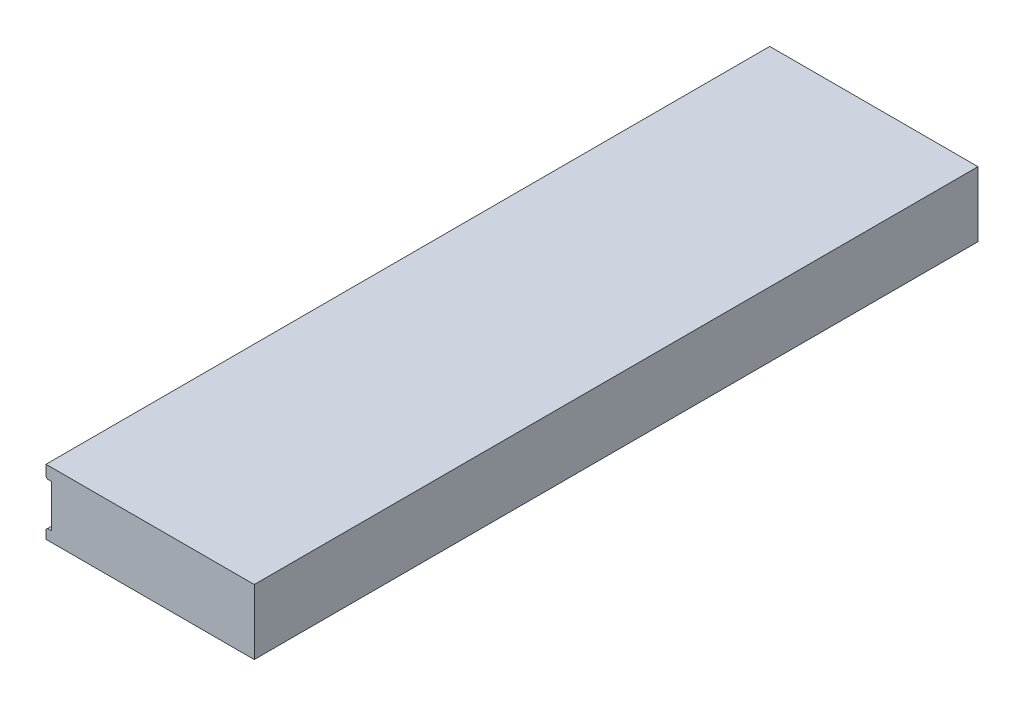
ISO-10303-21;
HEADER;
FILE_DESCRIPTION(('STEP AP214'),'2;1');
FILE_NAME('part.step','',(''),(''),'','','');
FILE_SCHEMA(('AUTOMOTIVE_DESIGN { 1 0 10303 214 1 1 1 1 }'));
ENDSEC;
DATA;
#1=APPLICATION_CONTEXT('core data for automotive mechanical design processes');
#2=APPLICATION_PROTOCOL_DEFINITION('international standard','automotive_design',2000,#1);
#3=PRODUCT_CONTEXT('',#1,'mechanical');
#4=PRODUCT('Part','Part','',(#3));
#5=PRODUCT_RELATED_PRODUCT_CATEGORY('part','',(#4));
#6=PRODUCT_DEFINITION_FORMATION('','',#4);
#7=PRODUCT_DEFINITION_CONTEXT('part definition',#1,'design');
#8=PRODUCT_DEFINITION('design','',#6,#7);
#9=PRODUCT_DEFINITION_SHAPE('','',#8);
#10=(LENGTH_UNIT() NAMED_UNIT(*) SI_UNIT(.MILLI.,.METRE.));
#11=(NAMED_UNIT(*) PLANE_ANGLE_UNIT() SI_UNIT($,.RADIAN.));
#12=(NAMED_UNIT(*) SI_UNIT($,.STERADIAN.) SOLID_ANGLE_UNIT());
#13=UNCERTAINTY_MEASURE_WITH_UNIT(LENGTH_MEASURE(1.E-05),#10,'distance_accuracy_value','');
#14=(GEOMETRIC_REPRESENTATION_CONTEXT(3) GLOBAL_UNCERTAINTY_ASSIGNED_CONTEXT((#13)) GLOBAL_UNIT_ASSIGNED_CONTEXT((#10,
#11,#12)) REPRESENTATION_CONTEXT('',''));
#15=CARTESIAN_POINT('',(0.,0.,0.));
#16=DIRECTION('',(0.,0.,1.));
#17=DIRECTION('',(1.,0.,0.));
#18=AXIS2_PLACEMENT_3D('',#15,#16,#17);
#19=CARTESIAN_POINT('',(-1.39699999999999,0.,90.4748));
#20=DIRECTION('',(0.,-1.,0.));
#21=DIRECTION('',(0.,0.,-1.));
#22=AXIS2_PLACEMENT_3D('',#19,#20,#21);
#23=PLANE('',#22);
#24=DIRECTION('',(-1.,0.,0.));
#25=VECTOR('',#24,1.);
#26=CARTESIAN_POINT('',(-1.39699999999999,0.,-90.4748));
#27=LINE('',#26,#25);
#28=CARTESIAN_POINT('',(50.673,0.,-90.4748));
#29=VERTEX_POINT('',#28);
#30=CARTESIAN_POINT('',(-1.39699999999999,0.,-90.4748));
#31=VERTEX_POINT('',#30);
#32=EDGE_CURVE('E180',#29,#31,#27,.T.);
#33=ORIENTED_EDGE('',*,*,#32,.T.);
#34=DIRECTION('',(0.,0.,-1.));
#35=VECTOR('',#34,1.);
#36=CARTESIAN_POINT('',(-1.39699999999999,0.,90.4748));
#37=LINE('',#36,#35);
#38=CARTESIAN_POINT('',(-1.39699999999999,0.,90.4748));
#39=VERTEX_POINT('',#38);
#40=EDGE_CURVE('E231',#39,#31,#37,.T.);
#41=ORIENTED_EDGE('',*,*,#40,.F.);
#42=DIRECTION('',(-1.,0.,0.));
#43=VECTOR('',#42,1.);
#44=CARTESIAN_POINT('',(-1.39699999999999,0.,90.4748));
#45=LINE('',#44,#43);
#46=CARTESIAN_POINT('',(50.673,0.,90.4748));
#47=VERTEX_POINT('',#46);
#48=EDGE_CURVE('E181',#47,#39,#45,.T.);
#49=ORIENTED_EDGE('',*,*,#48,.F.);
#50=DIRECTION('',(0.,0.,-1.));
#51=VECTOR('',#50,1.);
#52=CARTESIAN_POINT('',(50.673,0.,90.4748));
#53=LINE('',#52,#51);
#54=EDGE_CURVE('E200',#47,#29,#53,.T.);
#55=ORIENTED_EDGE('',*,*,#54,.T.);
#56=EDGE_LOOP('',(#33,#41,#49,#55));
#57=FACE_BOUND('',#56,.T.);
#58=ADVANCED_FACE('F37',(#57),#23,.F.);
#59=CARTESIAN_POINT('',(-1.39699999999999,-3.048,90.4748));
#60=DIRECTION('',(1.,0.,0.));
#61=DIRECTION('',(0.,0.,-1.));
#62=AXIS2_PLACEMENT_3D('',#59,#60,#61);
#63=PLANE('',#62);
#64=DIRECTION('',(0.,-1.,0.));
#65=VECTOR('',#64,1.);
#66=CARTESIAN_POINT('',(-1.39699999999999,-3.048,-90.4748));
#67=LINE('',#66,#65);
#68=CARTESIAN_POINT('',(-1.39699999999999,-2.66699999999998,-90.4748));
#69=VERTEX_POINT('',#68);
#70=EDGE_CURVE('E203',#31,#69,#67,.T.);
#71=ORIENTED_EDGE('',*,*,#70,.T.);
#72=DIRECTION('',(0.,0.,1.));
#73=VECTOR('',#72,1.);
#74=CARTESIAN_POINT('',(-1.39699999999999,-2.66699999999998,90.4748));
#75=LINE('',#74,#73);
#76=CARTESIAN_POINT('',(-1.39699999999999,-2.66699999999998,90.4748));
#77=VERTEX_POINT('',#76);
#78=EDGE_CURVE('E11',#69,#77,#75,.T.);
#79=ORIENTED_EDGE('',*,*,#78,.T.);
#80=DIRECTION('',(0.,-1.,0.));
#81=VECTOR('',#80,1.);
#82=CARTESIAN_POINT('',(-1.39699999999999,-3.048,90.4748));
#83=LINE('',#82,#81);
#84=EDGE_CURVE('E184',#39,#77,#83,.T.);
#85=ORIENTED_EDGE('',*,*,#84,.F.);
#86=ORIENTED_EDGE('',*,*,#40,.T.);
#87=EDGE_LOOP('',(#71,#79,#85,#86));
#88=FACE_BOUND('',#87,.T.);
#89=ADVANCED_FACE('F287',(#88),#63,.F.);
#90=CARTESIAN_POINT('',(0.,-3.048,90.4748));
#91=DIRECTION('',(0.,1.,0.));
#92=DIRECTION('',(0.,0.,1.));
#93=AXIS2_PLACEMENT_3D('',#90,#91,#92);
#94=PLANE('',#93);
#95=DIRECTION('',(1.,0.,0.));
#96=VECTOR('',#95,1.);
#97=CARTESIAN_POINT('',(0.,-3.048,90.4748));
#98=LINE('',#97,#96);
#99=CARTESIAN_POINT('',(-1.016,-3.048,90.4748));
#100=VERTEX_POINT('',#99);
#101=CARTESIAN_POINT('',(0.,-3.048,90.4748));
#102=VERTEX_POINT('',#101);
#103=EDGE_CURVE('E187',#100,#102,#98,.T.);
#104=ORIENTED_EDGE('',*,*,#103,.F.);
#105=DIRECTION('',(0.,0.,-1.));
#106=VECTOR('',#105,1.);
#107=CARTESIAN_POINT('',(-1.016,-3.048,90.4748));
#108=LINE('',#107,#106);
#109=CARTESIAN_POINT('',(-1.016,-3.048,-90.4748));
#110=VERTEX_POINT('',#109);
#111=EDGE_CURVE('E45',#100,#110,#108,.T.);
#112=ORIENTED_EDGE('',*,*,#111,.T.);
#113=DIRECTION('',(1.,0.,0.));
#114=VECTOR('',#113,1.);
#115=CARTESIAN_POINT('',(0.,-3.048,-90.4748));
#116=LINE('',#115,#114);
#117=CARTESIAN_POINT('',(0.,-3.048,-90.4748));
#118=VERTEX_POINT('',#117);
#119=EDGE_CURVE('E205',#110,#118,#116,.T.);
#120=ORIENTED_EDGE('',*,*,#119,.T.);
#121=DIRECTION('',(0.,0.,-1.));
#122=VECTOR('',#121,1.);
#123=CARTESIAN_POINT('',(0.,-3.048,90.4748));
#124=LINE('',#123,#122);
#125=EDGE_CURVE('E228',#102,#118,#124,.T.);
#126=ORIENTED_EDGE('',*,*,#125,.F.);
#127=EDGE_LOOP('',(#104,#112,#120,#126));
#128=FACE_BOUND('',#127,.T.);
#129=ADVANCED_FACE('F249',(#128),#94,.F.);
#130=CARTESIAN_POINT('',(0.,-13.716,90.4748));
#131=DIRECTION('',(1.,0.,0.));
#132=DIRECTION('',(0.,0.,-1.));
#133=AXIS2_PLACEMENT_3D('',#130,#131,#132);
#134=PLANE('',#133);
#135=CARTESIAN_POINT('',(0.,-8.12799999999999,-85.598));
#136=DIRECTION('',(-1.,0.,0.));
#137=DIRECTION('',(0.,0.,1.));
#138=AXIS2_PLACEMENT_3D('',#135,#136,#137);
#139=CIRCLE('',#138,2.413);
#140=CARTESIAN_POINT('',(0.,-8.12799999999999,-83.185));
#141=VERTEX_POINT('',#140);
#142=EDGE_CURVE('E141',#141,#141,#139,.T.);
#143=ORIENTED_EDGE('',*,*,#142,.F.);
#144=EDGE_LOOP('',(#143));
#145=FACE_BOUND('',#144,.T.);
#146=CARTESIAN_POINT('',(0.,-8.12799999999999,85.598));
#147=DIRECTION('',(-1.,0.,0.));
#148=DIRECTION('',(0.,0.,1.));
#149=AXIS2_PLACEMENT_3D('',#146,#147,#148);
#150=CIRCLE('',#149,2.413);
#151=CARTESIAN_POINT('',(0.,-8.12799999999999,88.011));
#152=VERTEX_POINT('',#151);
#153=EDGE_CURVE('E153',#152,#152,#150,.T.);
#154=ORIENTED_EDGE('',*,*,#153,.F.);
#155=EDGE_LOOP('',(#154));
#156=FACE_BOUND('',#155,.T.);
#157=CARTESIAN_POINT('',(0.,-8.128,4.8768));
#158=DIRECTION('',(-1.,0.,0.));
#159=DIRECTION('',(0.,0.,1.));
#160=AXIS2_PLACEMENT_3D('',#157,#158,#159);
#161=CIRCLE('',#160,2.413);
#162=CARTESIAN_POINT('',(0.,-8.128,7.2898));
#163=VERTEX_POINT('',#162);
#164=EDGE_CURVE('E165',#163,#163,#161,.T.);
#165=ORIENTED_EDGE('',*,*,#164,.F.);
#166=EDGE_LOOP('',(#165));
#167=FACE_BOUND('',#166,.T.);
#168=CARTESIAN_POINT('',(0.,-8.128,-4.8768));
#169=DIRECTION('',(-1.,0.,0.));
#170=DIRECTION('',(0.,0.,1.));
#171=AXIS2_PLACEMENT_3D('',#168,#169,#170);
#172=CIRCLE('',#171,2.413);
#173=CARTESIAN_POINT('',(0.,-8.128,-2.4638));
#174=VERTEX_POINT('',#173);
#175=EDGE_CURVE('E177',#174,#174,#172,.T.);
#176=ORIENTED_EDGE('',*,*,#175,.F.);
#177=EDGE_LOOP('',(#176));
#178=FACE_BOUND('',#177,.T.);
#179=DIRECTION('',(0.,-1.,0.));
#180=VECTOR('',#179,1.);
#181=CARTESIAN_POINT('',(0.,-13.716,-90.4748));
#182=LINE('',#181,#180);
#183=CARTESIAN_POINT('',(0.,-13.716,-90.4748));
#184=VERTEX_POINT('',#183);
#185=EDGE_CURVE('E207',#118,#184,#182,.T.);
#186=ORIENTED_EDGE('',*,*,#185,.T.);
#187=DIRECTION('',(0.,0.,-1.));
#188=VECTOR('',#187,1.);
#189=CARTESIAN_POINT('',(0.,-13.716,90.4748));
#190=LINE('',#189,#188);
#191=CARTESIAN_POINT('',(0.,-13.716,90.4748));
#192=VERTEX_POINT('',#191);
#193=EDGE_CURVE('E225',#192,#184,#190,.T.);
#194=ORIENTED_EDGE('',*,*,#193,.F.);
#195=DIRECTION('',(0.,-1.,0.));
#196=VECTOR('',#195,1.);
#197=CARTESIAN_POINT('',(0.,-13.716,90.4748));
#198=LINE('',#197,#196);
#199=EDGE_CURVE('E189',#102,#192,#198,.T.);
#200=ORIENTED_EDGE('',*,*,#199,.F.);
#201=ORIENTED_EDGE('',*,*,#125,.T.);
#202=EDGE_LOOP('',(#186,#194,#200,#201));
#203=FACE_BOUND('',#202,.T.);
#204=ADVANCED_FACE('F259',(#145,#156,#167,#178,#203),#134,.F.);
#205=CARTESIAN_POINT('',(-1.39699999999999,-13.716,90.4748));
#206=DIRECTION('',(0.,-1.,0.));
#207=DIRECTION('',(0.,0.,-1.));
#208=AXIS2_PLACEMENT_3D('',#205,#206,#207);
#209=PLANE('',#208);
#210=DIRECTION('',(-1.,0.,0.));
#211=VECTOR('',#210,1.);
#212=CARTESIAN_POINT('',(-1.39699999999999,-13.716,-90.4748));
#213=LINE('',#212,#211);
#214=CARTESIAN_POINT('',(-1.016,-13.716,-90.4748));
#215=VERTEX_POINT('',#214);
#216=EDGE_CURVE('E209',#184,#215,#213,.T.);
#217=ORIENTED_EDGE('',*,*,#216,.T.);
#218=DIRECTION('',(0.,0.,1.));
#219=VECTOR('',#218,1.);
#220=CARTESIAN_POINT('',(-1.016,-13.716,90.4748));
#221=LINE('',#220,#219);
#222=CARTESIAN_POINT('',(-1.016,-13.716,90.4748));
#223=VERTEX_POINT('',#222);
#224=EDGE_CURVE('E241',#215,#223,#221,.T.);
#225=ORIENTED_EDGE('',*,*,#224,.T.);
#226=DIRECTION('',(-1.,0.,0.));
#227=VECTOR('',#226,1.);
#228=CARTESIAN_POINT('',(-1.39699999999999,-13.716,90.4748));
#229=LINE('',#228,#227);
#230=EDGE_CURVE('E191',#192,#223,#229,.T.);
#231=ORIENTED_EDGE('',*,*,#230,.F.);
#232=ORIENTED_EDGE('',*,*,#193,.T.);
#233=EDGE_LOOP('',(#217,#225,#231,#232));
#234=FACE_BOUND('',#233,.T.);
#235=ADVANCED_FACE('F263',(#234),#209,.F.);
#236=CARTESIAN_POINT('',(-1.39699999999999,-16.256,90.4748));
#237=DIRECTION('',(1.,0.,0.));
#238=DIRECTION('',(0.,0.,-1.));
#239=AXIS2_PLACEMENT_3D('',#236,#237,#238);
#240=PLANE('',#239);
#241=DIRECTION('',(0.,-1.,0.));
#242=VECTOR('',#241,1.);
#243=CARTESIAN_POINT('',(-1.39699999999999,-16.256,90.4748));
#244=LINE('',#243,#242);
#245=CARTESIAN_POINT('',(-1.39699999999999,-14.097,90.4748));
#246=VERTEX_POINT('',#245);
#247=CARTESIAN_POINT('',(-1.39699999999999,-16.256,90.4748));
#248=VERTEX_POINT('',#247);
#249=EDGE_CURVE('E194',#246,#248,#244,.T.);
#250=ORIENTED_EDGE('',*,*,#249,.F.);
#251=DIRECTION('',(0.,0.,-1.));
#252=VECTOR('',#251,1.);
#253=CARTESIAN_POINT('',(-1.39699999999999,-14.097,90.4748));
#254=LINE('',#253,#252);
#255=CARTESIAN_POINT('',(-1.39699999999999,-14.097,-90.4748));
#256=VERTEX_POINT('',#255);
#257=EDGE_CURVE('E234',#246,#256,#254,.T.);
#258=ORIENTED_EDGE('',*,*,#257,.T.);
#259=DIRECTION('',(0.,-1.,0.));
#260=VECTOR('',#259,1.);
#261=CARTESIAN_POINT('',(-1.39699999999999,-16.256,-90.4748));
#262=LINE('',#261,#260);
#263=CARTESIAN_POINT('',(-1.39699999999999,-16.256,-90.4748));
#264=VERTEX_POINT('',#263);
#265=EDGE_CURVE('E212',#256,#264,#262,.T.);
#266=ORIENTED_EDGE('',*,*,#265,.T.);
#267=DIRECTION('',(0.,0.,-1.));
#268=VECTOR('',#267,1.);
#269=CARTESIAN_POINT('',(-1.39699999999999,-16.256,90.4748));
#270=LINE('',#269,#268);
#271=EDGE_CURVE('E222',#248,#264,#270,.T.);
#272=ORIENTED_EDGE('',*,*,#271,.F.);
#273=EDGE_LOOP('',(#250,#258,#266,#272));
#274=FACE_BOUND('',#273,.T.);
#275=ADVANCED_FACE('F271',(#274),#240,.F.);
#276=CARTESIAN_POINT('',(50.673,-16.256,90.4748));
#277=DIRECTION('',(0.,1.,0.));
#278=DIRECTION('',(-1.,0.,0.));
#279=AXIS2_PLACEMENT_3D('',#276,#277,#278);
#280=PLANE('',#279);
#281=DIRECTION('',(1.,0.,0.));
#282=VECTOR('',#281,1.);
#283=CARTESIAN_POINT('',(50.673,-16.256,-90.4748));
#284=LINE('',#283,#282);
#285=CARTESIAN_POINT('',(50.673,-16.256,-90.4748));
#286=VERTEX_POINT('',#285);
#287=EDGE_CURVE('E214',#264,#286,#284,.T.);
#288=ORIENTED_EDGE('',*,*,#287,.T.);
#289=DIRECTION('',(0.,0.,-1.));
#290=VECTOR('',#289,1.);
#291=CARTESIAN_POINT('',(50.673,-16.256,90.4748));
#292=LINE('',#291,#290);
#293=CARTESIAN_POINT('',(50.673,-16.256,90.4748));
#294=VERTEX_POINT('',#293);
#295=EDGE_CURVE('E219',#294,#286,#292,.T.);
#296=ORIENTED_EDGE('',*,*,#295,.F.);
#297=DIRECTION('',(1.,0.,0.));
#298=VECTOR('',#297,1.);
#299=CARTESIAN_POINT('',(50.673,-16.256,90.4748));
#300=LINE('',#299,#298);
#301=EDGE_CURVE('E196',#248,#294,#300,.T.);
#302=ORIENTED_EDGE('',*,*,#301,.F.);
#303=ORIENTED_EDGE('',*,*,#271,.T.);
#304=EDGE_LOOP('',(#288,#296,#302,#303));
#305=FACE_BOUND('',#304,.T.);
#306=ADVANCED_FACE('F278',(#305),#280,.F.);
#307=CARTESIAN_POINT('',(50.673,0.,90.4748));
#308=DIRECTION('',(-1.,0.,0.));
#309=DIRECTION('',(0.,0.,1.));
#310=AXIS2_PLACEMENT_3D('',#307,#308,#309);
#311=PLANE('',#310);
#312=DIRECTION('',(0.,1.,0.));
#313=VECTOR('',#312,1.);
#314=CARTESIAN_POINT('',(50.673,0.,-90.4748));
#315=LINE('',#314,#313);
#316=EDGE_CURVE('E185',#286,#29,#315,.T.);
#317=ORIENTED_EDGE('',*,*,#316,.T.);
#318=ORIENTED_EDGE('',*,*,#54,.F.);
#319=DIRECTION('',(0.,1.,0.));
#320=VECTOR('',#319,1.);
#321=CARTESIAN_POINT('',(50.673,0.,90.4748));
#322=LINE('',#321,#320);
#323=EDGE_CURVE('E198',#294,#47,#322,.T.);
#324=ORIENTED_EDGE('',*,*,#323,.F.);
#325=ORIENTED_EDGE('',*,*,#295,.T.);
#326=EDGE_LOOP('',(#317,#318,#324,#325));
#327=FACE_BOUND('',#326,.T.);
#328=ADVANCED_FACE('F282',(#327),#311,.F.);
#329=CARTESIAN_POINT('',(50.673,0.,90.4748));
#330=DIRECTION('',(0.,0.,-1.));
#331=DIRECTION('',(-1.,0.,0.));
#332=AXIS2_PLACEMENT_3D('',#329,#330,#331);
#333=PLANE('',#332);
#334=ORIENTED_EDGE('',*,*,#230,.T.);
#335=DIRECTION('',(0.707106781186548,0.707106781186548,0.));
#336=VECTOR('',#335,1.);
#337=CARTESIAN_POINT('',(-1.39699999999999,-14.097,90.4748));
#338=LINE('',#337,#336);
#339=EDGE_CURVE('E244',#223,#246,#338,.F.);
#340=ORIENTED_EDGE('',*,*,#339,.T.);
#341=ORIENTED_EDGE('',*,*,#249,.T.);
#342=ORIENTED_EDGE('',*,*,#301,.T.);
#343=ORIENTED_EDGE('',*,*,#323,.T.);
#344=ORIENTED_EDGE('',*,*,#48,.T.);
#345=ORIENTED_EDGE('',*,*,#84,.T.);
#346=DIRECTION('',(-0.707106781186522,0.707106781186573,0.));
#347=VECTOR('',#346,1.);
#348=CARTESIAN_POINT('',(-1.016,-3.048,90.4748));
#349=LINE('',#348,#347);
#350=EDGE_CURVE('E52',#77,#100,#349,.F.);
#351=ORIENTED_EDGE('',*,*,#350,.T.);
#352=ORIENTED_EDGE('',*,*,#103,.T.);
#353=ORIENTED_EDGE('',*,*,#199,.T.);
#354=EDGE_LOOP('',(#334,#340,#341,#342,#343,#344,#345,#351,#352,#353));
#355=FACE_BOUND('',#354,.T.);
#356=ADVANCED_FACE('F266',(#355),#333,.F.);
#357=CARTESIAN_POINT('',(50.673,0.,-90.4748));
#358=DIRECTION('',(0.,0.,-1.));
#359=DIRECTION('',(-1.,0.,0.));
#360=AXIS2_PLACEMENT_3D('',#357,#358,#359);
#361=PLANE('',#360);
#362=ORIENTED_EDGE('',*,*,#265,.F.);
#363=DIRECTION('',(-0.707106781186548,-0.707106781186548,0.));
#364=VECTOR('',#363,1.);
#365=CARTESIAN_POINT('',(31.6865,18.9865,-90.4748));
#366=LINE('',#365,#364);
#367=EDGE_CURVE('E239',#256,#215,#366,.F.);
#368=ORIENTED_EDGE('',*,*,#367,.T.);
#369=ORIENTED_EDGE('',*,*,#216,.F.);
#370=ORIENTED_EDGE('',*,*,#185,.F.);
#371=ORIENTED_EDGE('',*,*,#119,.F.);
#372=DIRECTION('',(0.707106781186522,-0.707106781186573,0.));
#373=VECTOR('',#372,1.);
#374=CARTESIAN_POINT('',(23.3044999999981,-27.3684999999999,-90.4748));
#375=LINE('',#374,#373);
#376=EDGE_CURVE('E237',#110,#69,#375,.F.);
#377=ORIENTED_EDGE('',*,*,#376,.T.);
#378=ORIENTED_EDGE('',*,*,#70,.F.);
#379=ORIENTED_EDGE('',*,*,#32,.F.);
#380=ORIENTED_EDGE('',*,*,#316,.F.);
#381=ORIENTED_EDGE('',*,*,#287,.F.);
#382=EDGE_LOOP('',(#362,#368,#369,#370,#371,#377,#378,#379,#380,#381));
#383=FACE_BOUND('',#382,.T.);
#384=ADVANCED_FACE('F255',(#383),#361,.T.);
#385=CARTESIAN_POINT('',(0.,-8.128,-4.8768));
#386=DIRECTION('',(-1.,0.,0.));
#387=DIRECTION('',(0.,0.,1.));
#388=AXIS2_PLACEMENT_3D('',#385,#386,#387);
#389=CYLINDRICAL_SURFACE('',#388,2.413);
#390=CARTESIAN_POINT('',(7.62,-8.128,-4.8768));
#391=DIRECTION('',(-1.,0.,0.));
#392=DIRECTION('',(0.,0.,1.));
#393=AXIS2_PLACEMENT_3D('',#390,#391,#392);
#394=CIRCLE('',#393,2.413);
#395=CARTESIAN_POINT('',(7.62,-8.128,-2.4638));
#396=VERTEX_POINT('',#395);
#397=EDGE_CURVE('E174',#396,#396,#394,.T.);
#398=ORIENTED_EDGE('',*,*,#397,.F.);
#399=EDGE_LOOP('',(#398));
#400=FACE_BOUND('',#399,.T.);
#401=ORIENTED_EDGE('',*,*,#175,.T.);
#402=EDGE_LOOP('',(#401));
#403=FACE_BOUND('',#402,.T.);
#404=ADVANCED_FACE('F314',(#400,#403),#389,.F.);
#405=CARTESIAN_POINT('',(7.62,-6.10870000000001,-4.8768));
#406=DIRECTION('',(1.,0.,0.));
#407=DIRECTION('',(0.,0.,-1.));
#408=AXIS2_PLACEMENT_3D('',#405,#406,#407);
#409=PLANE('',#408);
#410=CARTESIAN_POINT('',(7.62,-8.128,-4.8768));
#411=DIRECTION('',(-1.,0.,0.));
#412=DIRECTION('',(0.,0.,1.));
#413=AXIS2_PLACEMENT_3D('',#410,#411,#412);
#414=CIRCLE('',#413,2.0193);
#415=CARTESIAN_POINT('',(7.62,-8.128,-2.8575));
#416=VERTEX_POINT('',#415);
#417=EDGE_CURVE('E171',#416,#416,#414,.T.);
#418=ORIENTED_EDGE('',*,*,#417,.F.);
#419=EDGE_LOOP('',(#418));
#420=FACE_BOUND('',#419,.T.);
#421=ORIENTED_EDGE('',*,*,#397,.T.);
#422=EDGE_LOOP('',(#421));
#423=FACE_BOUND('',#422,.T.);
#424=ADVANCED_FACE('F319',(#420,#423),#409,.F.);
#425=CARTESIAN_POINT('',(0.,-8.128,-4.8768));
#426=DIRECTION('',(-1.,0.,0.));
#427=DIRECTION('',(0.,0.,1.));
#428=AXIS2_PLACEMENT_3D('',#425,#426,#427);
#429=CYLINDRICAL_SURFACE('',#428,2.0193);
#430=CARTESIAN_POINT('',(9.99744,-8.128,-4.8768));
#431=DIRECTION('',(-1.,0.,0.));
#432=DIRECTION('',(0.,0.,1.));
#433=AXIS2_PLACEMENT_3D('',#430,#431,#432);
#434=CIRCLE('',#433,2.0193);
#435=CARTESIAN_POINT('',(9.99744,-8.128,-2.8575));
#436=VERTEX_POINT('',#435);
#437=EDGE_CURVE('E168',#436,#436,#434,.T.);
#438=ORIENTED_EDGE('',*,*,#437,.F.);
#439=EDGE_LOOP('',(#438));
#440=FACE_BOUND('',#439,.T.);
#441=ORIENTED_EDGE('',*,*,#417,.T.);
#442=EDGE_LOOP('',(#441));
#443=FACE_BOUND('',#442,.T.);
#444=ADVANCED_FACE('F323',(#440,#443),#429,.F.);
#445=CARTESIAN_POINT('',(9.99744,-8.128,-4.8768));
#446=DIRECTION('',(-1.,0.,0.));
#447=DIRECTION('',(0.,0.,1.));
#448=AXIS2_PLACEMENT_3D('',#445,#446,#447);
#449=CONICAL_SURFACE('',#448,2.0193,1.02974425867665);
#450=CARTESIAN_POINT('',(11.2107578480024,-8.12800000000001,-4.8768));
#451=VERTEX_POINT('',#450);
#452=VERTEX_LOOP('',#451);
#453=FACE_BOUND('',#452,.T.);
#454=ORIENTED_EDGE('',*,*,#437,.T.);
#455=EDGE_LOOP('',(#454));
#456=FACE_BOUND('',#455,.T.);
#457=ADVANCED_FACE('F327',(#453,#456),#449,.F.);
#458=CARTESIAN_POINT('',(0.,-8.128,4.8768));
#459=DIRECTION('',(-1.,0.,0.));
#460=DIRECTION('',(0.,0.,1.));
#461=AXIS2_PLACEMENT_3D('',#458,#459,#460);
#462=CYLINDRICAL_SURFACE('',#461,2.413);
#463=CARTESIAN_POINT('',(7.62,-8.128,4.8768));
#464=DIRECTION('',(-1.,0.,0.));
#465=DIRECTION('',(0.,0.,1.));
#466=AXIS2_PLACEMENT_3D('',#463,#464,#465);
#467=CIRCLE('',#466,2.413);
#468=CARTESIAN_POINT('',(7.62,-8.128,7.2898));
#469=VERTEX_POINT('',#468);
#470=EDGE_CURVE('E162',#469,#469,#467,.T.);
#471=ORIENTED_EDGE('',*,*,#470,.F.);
#472=EDGE_LOOP('',(#471));
#473=FACE_BOUND('',#472,.T.);
#474=ORIENTED_EDGE('',*,*,#164,.T.);
#475=EDGE_LOOP('',(#474));
#476=FACE_BOUND('',#475,.T.);
#477=ADVANCED_FACE('F331',(#473,#476),#462,.F.);
#478=CARTESIAN_POINT('',(7.62,-6.10870000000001,4.8768));
#479=DIRECTION('',(1.,0.,0.));
#480=DIRECTION('',(0.,0.,-1.));
#481=AXIS2_PLACEMENT_3D('',#478,#479,#480);
#482=PLANE('',#481);
#483=CARTESIAN_POINT('',(7.62,-8.128,4.8768));
#484=DIRECTION('',(-1.,0.,0.));
#485=DIRECTION('',(0.,0.,1.));
#486=AXIS2_PLACEMENT_3D('',#483,#484,#485);
#487=CIRCLE('',#486,2.0193);
#488=CARTESIAN_POINT('',(7.62,-8.128,6.8961));
#489=VERTEX_POINT('',#488);
#490=EDGE_CURVE('E159',#489,#489,#487,.T.);
#491=ORIENTED_EDGE('',*,*,#490,.F.);
#492=EDGE_LOOP('',(#491));
#493=FACE_BOUND('',#492,.T.);
#494=ORIENTED_EDGE('',*,*,#470,.T.);
#495=EDGE_LOOP('',(#494));
#496=FACE_BOUND('',#495,.T.);
#497=ADVANCED_FACE('F335',(#493,#496),#482,.F.);
#498=CARTESIAN_POINT('',(0.,-8.128,4.8768));
#499=DIRECTION('',(-1.,0.,0.));
#500=DIRECTION('',(0.,0.,1.));
#501=AXIS2_PLACEMENT_3D('',#498,#499,#500);
#502=CYLINDRICAL_SURFACE('',#501,2.0193);
#503=CARTESIAN_POINT('',(9.99744,-8.128,4.8768));
#504=DIRECTION('',(-1.,0.,0.));
#505=DIRECTION('',(0.,0.,1.));
#506=AXIS2_PLACEMENT_3D('',#503,#504,#505);
#507=CIRCLE('',#506,2.0193);
#508=CARTESIAN_POINT('',(9.99744,-8.128,6.8961));
#509=VERTEX_POINT('',#508);
#510=EDGE_CURVE('E156',#509,#509,#507,.T.);
#511=ORIENTED_EDGE('',*,*,#510,.F.);
#512=EDGE_LOOP('',(#511));
#513=FACE_BOUND('',#512,.T.);
#514=ORIENTED_EDGE('',*,*,#490,.T.);
#515=EDGE_LOOP('',(#514));
#516=FACE_BOUND('',#515,.T.);
#517=ADVANCED_FACE('F339',(#513,#516),#502,.F.);
#518=CARTESIAN_POINT('',(9.99744,-8.128,4.8768));
#519=DIRECTION('',(-1.,0.,0.));
#520=DIRECTION('',(0.,0.,1.));
#521=AXIS2_PLACEMENT_3D('',#518,#519,#520);
#522=CONICAL_SURFACE('',#521,2.0193,1.02974425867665);
#523=CARTESIAN_POINT('',(11.2107578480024,-8.12800000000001,4.8768));
#524=VERTEX_POINT('',#523);
#525=VERTEX_LOOP('',#524);
#526=FACE_BOUND('',#525,.T.);
#527=ORIENTED_EDGE('',*,*,#510,.T.);
#528=EDGE_LOOP('',(#527));
#529=FACE_BOUND('',#528,.T.);
#530=ADVANCED_FACE('F343',(#526,#529),#522,.F.);
#531=CARTESIAN_POINT('',(0.,-8.12799999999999,85.598));
#532=DIRECTION('',(-1.,0.,0.));
#533=DIRECTION('',(0.,0.,1.));
#534=AXIS2_PLACEMENT_3D('',#531,#532,#533);
#535=CYLINDRICAL_SURFACE('',#534,2.413);
#536=CARTESIAN_POINT('',(7.62,-8.12799999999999,85.598));
#537=DIRECTION('',(-1.,0.,0.));
#538=DIRECTION('',(0.,0.,1.));
#539=AXIS2_PLACEMENT_3D('',#536,#537,#538);
#540=CIRCLE('',#539,2.413);
#541=CARTESIAN_POINT('',(7.62,-8.12799999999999,88.011));
#542=VERTEX_POINT('',#541);
#543=EDGE_CURVE('E150',#542,#542,#540,.T.);
#544=ORIENTED_EDGE('',*,*,#543,.F.);
#545=EDGE_LOOP('',(#544));
#546=FACE_BOUND('',#545,.T.);
#547=ORIENTED_EDGE('',*,*,#153,.T.);
#548=EDGE_LOOP('',(#547));
#549=FACE_BOUND('',#548,.T.);
#550=ADVANCED_FACE('F347',(#546,#549),#535,.F.);
#551=CARTESIAN_POINT('',(7.62,-6.10869999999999,85.598));
#552=DIRECTION('',(1.,0.,0.));
#553=DIRECTION('',(0.,0.,-1.));
#554=AXIS2_PLACEMENT_3D('',#551,#552,#553);
#555=PLANE('',#554);
#556=CARTESIAN_POINT('',(7.62,-8.12799999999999,85.598));
#557=DIRECTION('',(-1.,0.,0.));
#558=DIRECTION('',(0.,0.,1.));
#559=AXIS2_PLACEMENT_3D('',#556,#557,#558);
#560=CIRCLE('',#559,2.0193);
#561=CARTESIAN_POINT('',(7.62,-8.12799999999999,87.6173));
#562=VERTEX_POINT('',#561);
#563=EDGE_CURVE('E147',#562,#562,#560,.T.);
#564=ORIENTED_EDGE('',*,*,#563,.F.);
#565=EDGE_LOOP('',(#564));
#566=FACE_BOUND('',#565,.T.);
#567=ORIENTED_EDGE('',*,*,#543,.T.);
#568=EDGE_LOOP('',(#567));
#569=FACE_BOUND('',#568,.T.);
#570=ADVANCED_FACE('F351',(#566,#569),#555,.F.);
#571=CARTESIAN_POINT('',(0.,-8.12799999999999,85.598));
#572=DIRECTION('',(-1.,0.,0.));
#573=DIRECTION('',(0.,0.,1.));
#574=AXIS2_PLACEMENT_3D('',#571,#572,#573);
#575=CYLINDRICAL_SURFACE('',#574,2.0193);
#576=CARTESIAN_POINT('',(9.99744,-8.12799999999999,85.598));
#577=DIRECTION('',(-1.,0.,0.));
#578=DIRECTION('',(0.,0.,1.));
#579=AXIS2_PLACEMENT_3D('',#576,#577,#578);
#580=CIRCLE('',#579,2.0193);
#581=CARTESIAN_POINT('',(9.99744,-8.12799999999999,87.6173));
#582=VERTEX_POINT('',#581);
#583=EDGE_CURVE('E144',#582,#582,#580,.T.);
#584=ORIENTED_EDGE('',*,*,#583,.F.);
#585=EDGE_LOOP('',(#584));
#586=FACE_BOUND('',#585,.T.);
#587=ORIENTED_EDGE('',*,*,#563,.T.);
#588=EDGE_LOOP('',(#587));
#589=FACE_BOUND('',#588,.T.);
#590=ADVANCED_FACE('F355',(#586,#589),#575,.F.);
#591=CARTESIAN_POINT('',(9.99744,-8.12799999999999,85.598));
#592=DIRECTION('',(-1.,0.,0.));
#593=DIRECTION('',(0.,0.,1.));
#594=AXIS2_PLACEMENT_3D('',#591,#592,#593);
#595=CONICAL_SURFACE('',#594,2.0193,1.02974425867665);
#596=CARTESIAN_POINT('',(11.2107578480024,-8.12799999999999,85.598));
#597=VERTEX_POINT('',#596);
#598=VERTEX_LOOP('',#597);
#599=FACE_BOUND('',#598,.T.);
#600=ORIENTED_EDGE('',*,*,#583,.T.);
#601=EDGE_LOOP('',(#600));
#602=FACE_BOUND('',#601,.T.);
#603=ADVANCED_FACE('F359',(#599,#602),#595,.F.);
#604=CARTESIAN_POINT('',(0.,-8.12799999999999,-85.598));
#605=DIRECTION('',(-1.,0.,0.));
#606=DIRECTION('',(0.,0.,1.));
#607=AXIS2_PLACEMENT_3D('',#604,#605,#606);
#608=CYLINDRICAL_SURFACE('',#607,2.413);
#609=CARTESIAN_POINT('',(7.61999999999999,-8.12799999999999,-85.598));
#610=DIRECTION('',(-1.,0.,0.));
#611=DIRECTION('',(0.,0.,1.));
#612=AXIS2_PLACEMENT_3D('',#609,#610,#611);
#613=CIRCLE('',#612,2.413);
#614=CARTESIAN_POINT('',(7.61999999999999,-8.12799999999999,-83.185));
#615=VERTEX_POINT('',#614);
#616=EDGE_CURVE('E136',#615,#615,#613,.T.);
#617=ORIENTED_EDGE('',*,*,#616,.F.);
#618=EDGE_LOOP('',(#617));
#619=FACE_BOUND('',#618,.T.);
#620=ORIENTED_EDGE('',*,*,#142,.T.);
#621=EDGE_LOOP('',(#620));
#622=FACE_BOUND('',#621,.T.);
#623=ADVANCED_FACE('F363',(#619,#622),#608,.F.);
#624=CARTESIAN_POINT('',(7.61999999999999,-6.10869999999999,-85.598));
#625=DIRECTION('',(1.,0.,0.));
#626=DIRECTION('',(0.,0.,-1.));
#627=AXIS2_PLACEMENT_3D('',#624,#625,#626);
#628=PLANE('',#627);
#629=CARTESIAN_POINT('',(7.61999999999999,-8.12799999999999,-85.598));
#630=DIRECTION('',(-1.,0.,0.));
#631=DIRECTION('',(0.,0.,1.));
#632=AXIS2_PLACEMENT_3D('',#629,#630,#631);
#633=CIRCLE('',#632,2.0193);
#634=CARTESIAN_POINT('',(7.61999999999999,-8.12799999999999,-83.5787));
#635=VERTEX_POINT('',#634);
#636=EDGE_CURVE('E133',#635,#635,#633,.T.);
#637=ORIENTED_EDGE('',*,*,#636,.F.);
#638=EDGE_LOOP('',(#637));
#639=FACE_BOUND('',#638,.T.);
#640=ORIENTED_EDGE('',*,*,#616,.T.);
#641=EDGE_LOOP('',(#640));
#642=FACE_BOUND('',#641,.T.);
#643=ADVANCED_FACE('F367',(#639,#642),#628,.F.);
#644=CARTESIAN_POINT('',(0.,-8.12799999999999,-85.598));
#645=DIRECTION('',(-1.,0.,0.));
#646=DIRECTION('',(0.,0.,1.));
#647=AXIS2_PLACEMENT_3D('',#644,#645,#646);
#648=CYLINDRICAL_SURFACE('',#647,2.0193);
#649=CARTESIAN_POINT('',(9.99743999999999,-8.12799999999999,-85.598));
#650=DIRECTION('',(-1.,0.,0.));
#651=DIRECTION('',(0.,0.,1.));
#652=AXIS2_PLACEMENT_3D('',#649,#650,#651);
#653=CIRCLE('',#652,2.0193);
#654=CARTESIAN_POINT('',(9.99743999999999,-8.12799999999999,-83.5787));
#655=VERTEX_POINT('',#654);
#656=EDGE_CURVE('E131',#655,#655,#653,.T.);
#657=ORIENTED_EDGE('',*,*,#656,.F.);
#658=EDGE_LOOP('',(#657));
#659=FACE_BOUND('',#658,.T.);
#660=ORIENTED_EDGE('',*,*,#636,.T.);
#661=EDGE_LOOP('',(#660));
#662=FACE_BOUND('',#661,.T.);
#663=ADVANCED_FACE('F127',(#659,#662),#648,.F.);
#664=CARTESIAN_POINT('',(9.99743999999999,-8.12799999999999,-85.598));
#665=DIRECTION('',(-1.,0.,0.));
#666=DIRECTION('',(0.,0.,1.));
#667=AXIS2_PLACEMENT_3D('',#664,#665,#666);
#668=CONICAL_SURFACE('',#667,2.0193,1.02974425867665);
#669=CARTESIAN_POINT('',(11.2107578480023,-8.12799999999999,-85.598));
#670=VERTEX_POINT('',#669);
#671=VERTEX_LOOP('',#670);
#672=FACE_BOUND('',#671,.T.);
#673=ORIENTED_EDGE('',*,*,#656,.T.);
#674=EDGE_LOOP('',(#673));
#675=FACE_BOUND('',#674,.T.);
#676=ADVANCED_FACE('F123',(#672,#675),#668,.F.);
#677=CARTESIAN_POINT('',(-1.39699999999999,-14.097,90.4748));
#678=DIRECTION('',(0.707106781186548,-0.707106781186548,0.));
#679=DIRECTION('',(0.707106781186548,0.707106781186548,0.));
#680=AXIS2_PLACEMENT_3D('',#677,#678,#679);
#681=PLANE('',#680);
#682=ORIENTED_EDGE('',*,*,#339,.F.);
#683=ORIENTED_EDGE('',*,*,#224,.F.);
#684=ORIENTED_EDGE('',*,*,#367,.F.);
#685=ORIENTED_EDGE('',*,*,#257,.F.);
#686=EDGE_LOOP('',(#682,#683,#684,#685));
#687=FACE_BOUND('',#686,.T.);
#688=ADVANCED_FACE('F126',(#687),#681,.F.);
#689=CARTESIAN_POINT('',(-1.016,-3.048,90.4748));
#690=DIRECTION('',(0.707106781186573,0.707106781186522,0.));
#691=DIRECTION('',(-0.707106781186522,0.707106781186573,0.));
#692=AXIS2_PLACEMENT_3D('',#689,#690,#691);
#693=PLANE('',#692);
#694=ORIENTED_EDGE('',*,*,#350,.F.);
#695=ORIENTED_EDGE('',*,*,#78,.F.);
#696=ORIENTED_EDGE('',*,*,#376,.F.);
#697=ORIENTED_EDGE('',*,*,#111,.F.);
#698=EDGE_LOOP('',(#694,#695,#696,#697));
#699=FACE_BOUND('',#698,.T.);
#700=ADVANCED_FACE('F39',(#699),#693,.F.);
#701=CLOSED_SHELL('',(#58,#89,#129,#204,#235,#275,#306,#328,#356,#384,#404,#424,#444,#457,#477,
#497,#517,#530,#550,#570,#590,#603,#623,#643,#663,#676,#688,#700));
#702=MANIFOLD_SOLID_BREP('B2',#701);
#703=ADVANCED_BREP_SHAPE_REPRESENTATION('',(#18,#702),#14);
#704=SHAPE_DEFINITION_REPRESENTATION(#9,#703);
ENDSEC;
END-ISO-10303-21;
